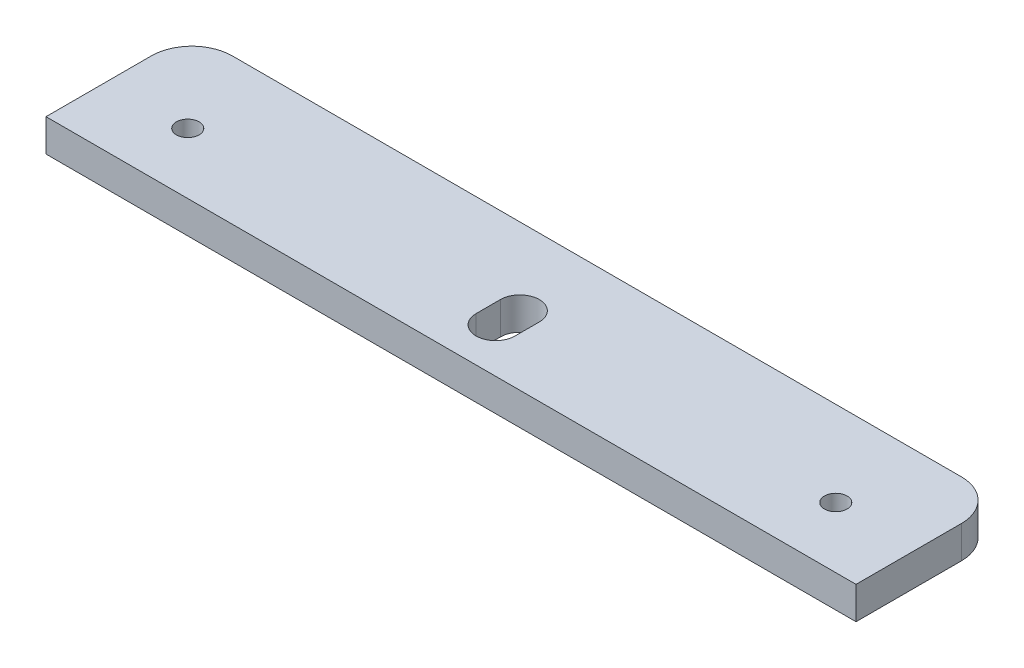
ISO-10303-21;
HEADER;
FILE_DESCRIPTION(('STEP AP214'),'2;1');
FILE_NAME('part.step','',(''),(''),'','','');
FILE_SCHEMA(('AUTOMOTIVE_DESIGN { 1 0 10303 214 1 1 1 1 }'));
ENDSEC;
DATA;
#1=APPLICATION_CONTEXT('core data for automotive mechanical design processes');
#2=APPLICATION_PROTOCOL_DEFINITION('international standard','automotive_design',2000,#1);
#3=PRODUCT_CONTEXT('',#1,'mechanical');
#4=PRODUCT('Part','Part','',(#3));
#5=PRODUCT_RELATED_PRODUCT_CATEGORY('part','',(#4));
#6=PRODUCT_DEFINITION_FORMATION('','',#4);
#7=PRODUCT_DEFINITION_CONTEXT('part definition',#1,'design');
#8=PRODUCT_DEFINITION('design','',#6,#7);
#9=PRODUCT_DEFINITION_SHAPE('','',#8);
#10=(LENGTH_UNIT() NAMED_UNIT(*) SI_UNIT(.MILLI.,.METRE.));
#11=(NAMED_UNIT(*) PLANE_ANGLE_UNIT() SI_UNIT($,.RADIAN.));
#12=(NAMED_UNIT(*) SI_UNIT($,.STERADIAN.) SOLID_ANGLE_UNIT());
#13=UNCERTAINTY_MEASURE_WITH_UNIT(LENGTH_MEASURE(1.E-05),#10,'distance_accuracy_value','');
#14=(GEOMETRIC_REPRESENTATION_CONTEXT(3) GLOBAL_UNCERTAINTY_ASSIGNED_CONTEXT((#13)) GLOBAL_UNIT_ASSIGNED_CONTEXT((#10,
#11,#12)) REPRESENTATION_CONTEXT('',''));
#15=CARTESIAN_POINT('',(0.,0.,0.));
#16=DIRECTION('',(0.,0.,1.));
#17=DIRECTION('',(1.,0.,0.));
#18=AXIS2_PLACEMENT_3D('',#15,#16,#17);
#19=CARTESIAN_POINT('',(0.,5.08,0.));
#20=DIRECTION('',(0.,1.,0.));
#21=DIRECTION('',(0.,0.,1.));
#22=AXIS2_PLACEMENT_3D('',#19,#20,#21);
#23=PLANE('',#22);
#24=CARTESIAN_POINT('',(50.8,5.08,-9.525));
#25=DIRECTION('',(0.,-1.,0.));
#26=DIRECTION('',(0.,0.,1.));
#27=AXIS2_PLACEMENT_3D('',#24,#25,#26);
#28=CIRCLE('',#27,1.778);
#29=CARTESIAN_POINT('',(50.8,5.08,-7.747));
#30=VERTEX_POINT('',#29);
#31=EDGE_CURVE('E263',#30,#30,#28,.T.);
#32=ORIENTED_EDGE('',*,*,#31,.T.);
#33=EDGE_LOOP('',(#32));
#34=FACE_BOUND('',#33,.T.);
#35=DIRECTION('',(0.,0.,1.));
#36=VECTOR('',#35,1.);
#37=CARTESIAN_POINT('',(63.5,5.08,0.));
#38=LINE('',#37,#36);
#39=CARTESIAN_POINT('',(63.5,5.08,-16.51));
#40=VERTEX_POINT('',#39);
#41=CARTESIAN_POINT('',(63.5,5.08,0.));
#42=VERTEX_POINT('',#41);
#43=EDGE_CURVE('E141',#40,#42,#38,.T.);
#44=ORIENTED_EDGE('',*,*,#43,.F.);
#45=CARTESIAN_POINT('',(57.15,5.08,-16.51));
#46=DIRECTION('',(0.,1.,0.));
#47=DIRECTION('',(0.,0.,1.));
#48=AXIS2_PLACEMENT_3D('',#45,#46,#47);
#49=CIRCLE('',#48,6.35);
#50=CARTESIAN_POINT('',(57.15,5.08,-22.86));
#51=VERTEX_POINT('',#50);
#52=EDGE_CURVE('E11',#40,#51,#49,.T.);
#53=ORIENTED_EDGE('',*,*,#52,.T.);
#54=DIRECTION('',(-1.,0.,0.));
#55=VECTOR('',#54,1.);
#56=CARTESIAN_POINT('',(0.,5.08,-22.86));
#57=LINE('',#56,#55);
#58=CARTESIAN_POINT('',(-57.15,5.08,-22.86));
#59=VERTEX_POINT('',#58);
#60=EDGE_CURVE('E165',#51,#59,#57,.T.);
#61=ORIENTED_EDGE('',*,*,#60,.T.);
#62=CARTESIAN_POINT('',(-57.15,5.08,-16.51));
#63=DIRECTION('',(0.,1.,0.));
#64=DIRECTION('',(0.,0.,1.));
#65=AXIS2_PLACEMENT_3D('',#62,#63,#64);
#66=CIRCLE('',#65,6.35);
#67=CARTESIAN_POINT('',(-63.5,5.08,-16.51));
#68=VERTEX_POINT('',#67);
#69=EDGE_CURVE('E190',#59,#68,#66,.T.);
#70=ORIENTED_EDGE('',*,*,#69,.T.);
#71=DIRECTION('',(0.,0.,1.));
#72=VECTOR('',#71,1.);
#73=CARTESIAN_POINT('',(-63.5,5.08,0.));
#74=LINE('',#73,#72);
#75=CARTESIAN_POINT('',(-63.5,5.08,0.));
#76=VERTEX_POINT('',#75);
#77=EDGE_CURVE('E167',#68,#76,#74,.T.);
#78=ORIENTED_EDGE('',*,*,#77,.T.);
#79=DIRECTION('',(1.,0.,0.));
#80=VECTOR('',#79,1.);
#81=CARTESIAN_POINT('',(0.,5.08,0.));
#82=LINE('',#81,#80);
#83=EDGE_CURVE('E170',#76,#42,#82,.T.);
#84=ORIENTED_EDGE('',*,*,#83,.T.);
#85=EDGE_LOOP('',(#44,#53,#61,#70,#78,#84));
#86=FACE_BOUND('',#85,.T.);
#87=CARTESIAN_POINT('',(-50.8,5.08,-9.525));
#88=DIRECTION('',(0.,1.,0.));
#89=DIRECTION('',(0.,0.,1.));
#90=AXIS2_PLACEMENT_3D('',#87,#88,#89);
#91=CIRCLE('',#90,1.778);
#92=CARTESIAN_POINT('',(-50.8,5.08,-7.747));
#93=VERTEX_POINT('',#92);
#94=EDGE_CURVE('E147',#93,#93,#91,.T.);
#95=ORIENTED_EDGE('',*,*,#94,.F.);
#96=EDGE_LOOP('',(#95));
#97=FACE_BOUND('',#96,.T.);
#98=CARTESIAN_POINT('',(0.,5.08,-10.795));
#99=DIRECTION('',(0.,1.,0.));
#100=DIRECTION('',(0.,0.,1.));
#101=AXIS2_PLACEMENT_3D('',#98,#99,#100);
#102=CIRCLE('',#101,3.048);
#103=CARTESIAN_POINT('',(3.048,5.08,-10.795));
#104=VERTEX_POINT('',#103);
#105=CARTESIAN_POINT('',(-3.048,5.08,-10.795));
#106=VERTEX_POINT('',#105);
#107=EDGE_CURVE('E151',#104,#106,#102,.T.);
#108=ORIENTED_EDGE('',*,*,#107,.F.);
#109=DIRECTION('',(0.,0.,1.));
#110=VECTOR('',#109,1.);
#111=CARTESIAN_POINT('',(3.048,5.08,-10.795));
#112=LINE('',#111,#110);
#113=CARTESIAN_POINT('',(3.048,5.08,-6.98499999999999));
#114=VERTEX_POINT('',#113);
#115=EDGE_CURVE('E131',#104,#114,#112,.T.);
#116=ORIENTED_EDGE('',*,*,#115,.T.);
#117=CARTESIAN_POINT('',(0.,5.08,-6.985));
#118=DIRECTION('',(0.,1.,0.));
#119=DIRECTION('',(0.,0.,1.));
#120=AXIS2_PLACEMENT_3D('',#117,#118,#119);
#121=CIRCLE('',#120,3.048);
#122=CARTESIAN_POINT('',(-3.048,5.08,-6.98499999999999));
#123=VERTEX_POINT('',#122);
#124=EDGE_CURVE('E135',#123,#114,#121,.T.);
#125=ORIENTED_EDGE('',*,*,#124,.F.);
#126=DIRECTION('',(0.,0.,1.));
#127=VECTOR('',#126,1.);
#128=CARTESIAN_POINT('',(-3.048,5.08,-10.795));
#129=LINE('',#128,#127);
#130=EDGE_CURVE('E156',#106,#123,#129,.T.);
#131=ORIENTED_EDGE('',*,*,#130,.F.);
#132=EDGE_LOOP('',(#108,#116,#125,#131));
#133=FACE_BOUND('',#132,.T.);
#134=ADVANCED_FACE('F35',(#34,#86,#97,#133),#23,.T.);
#135=CARTESIAN_POINT('',(0.,0.,0.));
#136=DIRECTION('',(0.,1.,0.));
#137=DIRECTION('',(0.,0.,1.));
#138=AXIS2_PLACEMENT_3D('',#135,#136,#137);
#139=PLANE('',#138);
#140=CARTESIAN_POINT('',(50.8,0.,-9.525));
#141=DIRECTION('',(0.,-1.,0.));
#142=DIRECTION('',(0.,0.,1.));
#143=AXIS2_PLACEMENT_3D('',#140,#141,#142);
#144=CIRCLE('',#143,1.778);
#145=CARTESIAN_POINT('',(50.8,0.,-7.747));
#146=VERTEX_POINT('',#145);
#147=EDGE_CURVE('E261',#146,#146,#144,.T.);
#148=ORIENTED_EDGE('',*,*,#147,.F.);
#149=EDGE_LOOP('',(#148));
#150=FACE_BOUND('',#149,.T.);
#151=CARTESIAN_POINT('',(-50.8,0.,-9.525));
#152=DIRECTION('',(0.,1.,0.));
#153=DIRECTION('',(0.,0.,1.));
#154=AXIS2_PLACEMENT_3D('',#151,#152,#153);
#155=CIRCLE('',#154,1.778);
#156=CARTESIAN_POINT('',(-50.8,0.,-7.747));
#157=VERTEX_POINT('',#156);
#158=EDGE_CURVE('E148',#157,#157,#155,.T.);
#159=ORIENTED_EDGE('',*,*,#158,.T.);
#160=EDGE_LOOP('',(#159));
#161=FACE_BOUND('',#160,.T.);
#162=DIRECTION('',(-1.,0.,0.));
#163=VECTOR('',#162,1.);
#164=CARTESIAN_POINT('',(0.,0.,-22.86));
#165=LINE('',#164,#163);
#166=CARTESIAN_POINT('',(57.15,0.,-22.86));
#167=VERTEX_POINT('',#166);
#168=CARTESIAN_POINT('',(-57.15,0.,-22.86));
#169=VERTEX_POINT('',#168);
#170=EDGE_CURVE('E162',#167,#169,#165,.T.);
#171=ORIENTED_EDGE('',*,*,#170,.F.);
#172=CARTESIAN_POINT('',(57.15,0.,-16.51));
#173=DIRECTION('',(0.,1.,0.));
#174=DIRECTION('',(0.,0.,1.));
#175=AXIS2_PLACEMENT_3D('',#172,#173,#174);
#176=CIRCLE('',#175,6.35);
#177=CARTESIAN_POINT('',(63.5,0.,-16.51));
#178=VERTEX_POINT('',#177);
#179=EDGE_CURVE('E57',#167,#178,#176,.F.);
#180=ORIENTED_EDGE('',*,*,#179,.T.);
#181=DIRECTION('',(0.,0.,1.));
#182=VECTOR('',#181,1.);
#183=CARTESIAN_POINT('',(63.5,0.,0.));
#184=LINE('',#183,#182);
#185=CARTESIAN_POINT('',(63.5,0.,0.));
#186=VERTEX_POINT('',#185);
#187=EDGE_CURVE('E137',#178,#186,#184,.T.);
#188=ORIENTED_EDGE('',*,*,#187,.T.);
#189=DIRECTION('',(1.,0.,0.));
#190=VECTOR('',#189,1.);
#191=CARTESIAN_POINT('',(0.,0.,0.));
#192=LINE('',#191,#190);
#193=CARTESIAN_POINT('',(-63.5,0.,0.));
#194=VERTEX_POINT('',#193);
#195=EDGE_CURVE('E168',#194,#186,#192,.T.);
#196=ORIENTED_EDGE('',*,*,#195,.F.);
#197=DIRECTION('',(0.,0.,1.));
#198=VECTOR('',#197,1.);
#199=CARTESIAN_POINT('',(-63.5,0.,0.));
#200=LINE('',#199,#198);
#201=CARTESIAN_POINT('',(-63.5,0.,-16.51));
#202=VERTEX_POINT('',#201);
#203=EDGE_CURVE('E175',#202,#194,#200,.T.);
#204=ORIENTED_EDGE('',*,*,#203,.F.);
#205=CARTESIAN_POINT('',(-57.15,0.,-16.51));
#206=DIRECTION('',(0.,1.,0.));
#207=DIRECTION('',(0.,0.,1.));
#208=AXIS2_PLACEMENT_3D('',#205,#206,#207);
#209=CIRCLE('',#208,6.35);
#210=EDGE_CURVE('E184',#202,#169,#209,.F.);
#211=ORIENTED_EDGE('',*,*,#210,.T.);
#212=EDGE_LOOP('',(#171,#180,#188,#196,#204,#211));
#213=FACE_BOUND('',#212,.T.);
#214=DIRECTION('',(0.,0.,1.));
#215=VECTOR('',#214,1.);
#216=CARTESIAN_POINT('',(3.048,0.,-10.795));
#217=LINE('',#216,#215);
#218=CARTESIAN_POINT('',(3.048,0.,-10.795));
#219=VERTEX_POINT('',#218);
#220=CARTESIAN_POINT('',(3.048,0.,-6.98499999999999));
#221=VERTEX_POINT('',#220);
#222=EDGE_CURVE('E114',#219,#221,#217,.T.);
#223=ORIENTED_EDGE('',*,*,#222,.F.);
#224=CARTESIAN_POINT('',(0.,0.,-10.795));
#225=DIRECTION('',(0.,1.,0.));
#226=DIRECTION('',(0.,0.,1.));
#227=AXIS2_PLACEMENT_3D('',#224,#225,#226);
#228=CIRCLE('',#227,3.048);
#229=CARTESIAN_POINT('',(-3.048,0.,-10.795));
#230=VERTEX_POINT('',#229);
#231=EDGE_CURVE('E192',#219,#230,#228,.T.);
#232=ORIENTED_EDGE('',*,*,#231,.T.);
#233=DIRECTION('',(0.,0.,1.));
#234=VECTOR('',#233,1.);
#235=CARTESIAN_POINT('',(-3.048,0.,-10.795));
#236=LINE('',#235,#234);
#237=CARTESIAN_POINT('',(-3.048,0.,-6.98499999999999));
#238=VERTEX_POINT('',#237);
#239=EDGE_CURVE('E116',#230,#238,#236,.T.);
#240=ORIENTED_EDGE('',*,*,#239,.T.);
#241=CARTESIAN_POINT('',(0.,0.,-6.985));
#242=DIRECTION('',(0.,1.,0.));
#243=DIRECTION('',(0.,0.,1.));
#244=AXIS2_PLACEMENT_3D('',#241,#242,#243);
#245=CIRCLE('',#244,3.048);
#246=EDGE_CURVE('E110',#238,#221,#245,.T.);
#247=ORIENTED_EDGE('',*,*,#246,.T.);
#248=EDGE_LOOP('',(#223,#232,#240,#247));
#249=FACE_BOUND('',#248,.T.);
#250=ADVANCED_FACE('F112',(#150,#161,#213,#249),#139,.F.);
#251=CARTESIAN_POINT('',(0.,5.08,-22.86));
#252=DIRECTION('',(0.,0.,1.));
#253=DIRECTION('',(1.,0.,0.));
#254=AXIS2_PLACEMENT_3D('',#251,#252,#253);
#255=PLANE('',#254);
#256=ORIENTED_EDGE('',*,*,#60,.F.);
#257=DIRECTION('',(0.,-1.,0.));
#258=VECTOR('',#257,1.);
#259=CARTESIAN_POINT('',(57.15,0.,-22.86));
#260=LINE('',#259,#258);
#261=EDGE_CURVE('E194',#51,#167,#260,.T.);
#262=ORIENTED_EDGE('',*,*,#261,.T.);
#263=ORIENTED_EDGE('',*,*,#170,.T.);
#264=DIRECTION('',(0.,-1.,0.));
#265=VECTOR('',#264,1.);
#266=CARTESIAN_POINT('',(-57.15,5.08,-22.86));
#267=LINE('',#266,#265);
#268=EDGE_CURVE('E187',#169,#59,#267,.F.);
#269=ORIENTED_EDGE('',*,*,#268,.T.);
#270=EDGE_LOOP('',(#256,#262,#263,#269));
#271=FACE_BOUND('',#270,.T.);
#272=ADVANCED_FACE('F200',(#271),#255,.F.);
#273=CARTESIAN_POINT('',(-63.5,5.08,0.));
#274=DIRECTION('',(1.,0.,0.));
#275=DIRECTION('',(0.,0.,-1.));
#276=AXIS2_PLACEMENT_3D('',#273,#274,#275);
#277=PLANE('',#276);
#278=ORIENTED_EDGE('',*,*,#77,.F.);
#279=DIRECTION('',(0.,-1.,0.));
#280=VECTOR('',#279,1.);
#281=CARTESIAN_POINT('',(-63.5,5.08,-16.51));
#282=LINE('',#281,#280);
#283=EDGE_CURVE('E181',#68,#202,#282,.T.);
#284=ORIENTED_EDGE('',*,*,#283,.T.);
#285=ORIENTED_EDGE('',*,*,#203,.T.);
#286=DIRECTION('',(0.,-1.,0.));
#287=VECTOR('',#286,1.);
#288=CARTESIAN_POINT('',(-63.5,5.08,0.));
#289=LINE('',#288,#287);
#290=EDGE_CURVE('E173',#76,#194,#289,.T.);
#291=ORIENTED_EDGE('',*,*,#290,.F.);
#292=EDGE_LOOP('',(#278,#284,#285,#291));
#293=FACE_BOUND('',#292,.T.);
#294=ADVANCED_FACE('F215',(#293),#277,.F.);
#295=CARTESIAN_POINT('',(0.,5.08,0.));
#296=DIRECTION('',(0.,0.,-1.));
#297=DIRECTION('',(-1.,0.,0.));
#298=AXIS2_PLACEMENT_3D('',#295,#296,#297);
#299=PLANE('',#298);
#300=ORIENTED_EDGE('',*,*,#195,.T.);
#301=DIRECTION('',(0.,-1.,0.));
#302=VECTOR('',#301,1.);
#303=CARTESIAN_POINT('',(63.5,5.08,0.));
#304=LINE('',#303,#302);
#305=EDGE_CURVE('E143',#42,#186,#304,.T.);
#306=ORIENTED_EDGE('',*,*,#305,.F.);
#307=ORIENTED_EDGE('',*,*,#83,.F.);
#308=ORIENTED_EDGE('',*,*,#290,.T.);
#309=EDGE_LOOP('',(#300,#306,#307,#308));
#310=FACE_BOUND('',#309,.T.);
#311=ADVANCED_FACE('F219',(#310),#299,.F.);
#312=CARTESIAN_POINT('',(-57.15,5.08,-16.51));
#313=DIRECTION('',(0.,-1.,0.));
#314=DIRECTION('',(0.,0.,-1.));
#315=AXIS2_PLACEMENT_3D('',#312,#313,#314);
#316=CYLINDRICAL_SURFACE('',#315,6.35);
#317=ORIENTED_EDGE('',*,*,#69,.F.);
#318=ORIENTED_EDGE('',*,*,#268,.F.);
#319=ORIENTED_EDGE('',*,*,#210,.F.);
#320=ORIENTED_EDGE('',*,*,#283,.F.);
#321=EDGE_LOOP('',(#317,#318,#319,#320));
#322=FACE_BOUND('',#321,.T.);
#323=ADVANCED_FACE('F209',(#322),#316,.T.);
#324=CARTESIAN_POINT('',(0.,0.,-10.795));
#325=DIRECTION('',(0.,1.,0.));
#326=DIRECTION('',(0.,0.,1.));
#327=AXIS2_PLACEMENT_3D('',#324,#325,#326);
#328=CYLINDRICAL_SURFACE('',#327,3.048);
#329=ORIENTED_EDGE('',*,*,#107,.T.);
#330=DIRECTION('',(0.,1.,0.));
#331=VECTOR('',#330,1.);
#332=CARTESIAN_POINT('',(-3.048,0.,-10.795));
#333=LINE('',#332,#331);
#334=EDGE_CURVE('E120',#230,#106,#333,.T.);
#335=ORIENTED_EDGE('',*,*,#334,.F.);
#336=ORIENTED_EDGE('',*,*,#231,.F.);
#337=DIRECTION('',(0.,1.,0.));
#338=VECTOR('',#337,1.);
#339=CARTESIAN_POINT('',(3.048,0.,-10.795));
#340=LINE('',#339,#338);
#341=EDGE_CURVE('E130',#219,#104,#340,.T.);
#342=ORIENTED_EDGE('',*,*,#341,.T.);
#343=EDGE_LOOP('',(#329,#335,#336,#342));
#344=FACE_BOUND('',#343,.T.);
#345=ADVANCED_FACE('F240',(#344),#328,.F.);
#346=CARTESIAN_POINT('',(0.,0.,-6.985));
#347=DIRECTION('',(0.,1.,0.));
#348=DIRECTION('',(0.,0.,1.));
#349=AXIS2_PLACEMENT_3D('',#346,#347,#348);
#350=CYLINDRICAL_SURFACE('',#349,3.048);
#351=ORIENTED_EDGE('',*,*,#246,.F.);
#352=DIRECTION('',(0.,1.,0.));
#353=VECTOR('',#352,1.);
#354=CARTESIAN_POINT('',(-3.048,0.,-6.98499999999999));
#355=LINE('',#354,#353);
#356=EDGE_CURVE('E160',#238,#123,#355,.T.);
#357=ORIENTED_EDGE('',*,*,#356,.T.);
#358=ORIENTED_EDGE('',*,*,#124,.T.);
#359=DIRECTION('',(0.,1.,0.));
#360=VECTOR('',#359,1.);
#361=CARTESIAN_POINT('',(3.048,0.,-6.98499999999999));
#362=LINE('',#361,#360);
#363=EDGE_CURVE('E127',#221,#114,#362,.T.);
#364=ORIENTED_EDGE('',*,*,#363,.F.);
#365=EDGE_LOOP('',(#351,#357,#358,#364));
#366=FACE_BOUND('',#365,.T.);
#367=ADVANCED_FACE('F133',(#366),#350,.F.);
#368=CARTESIAN_POINT('',(-3.048,0.,-10.795));
#369=DIRECTION('',(-1.,0.,0.));
#370=DIRECTION('',(0.,0.,1.));
#371=AXIS2_PLACEMENT_3D('',#368,#369,#370);
#372=PLANE('',#371);
#373=ORIENTED_EDGE('',*,*,#130,.T.);
#374=ORIENTED_EDGE('',*,*,#356,.F.);
#375=ORIENTED_EDGE('',*,*,#239,.F.);
#376=ORIENTED_EDGE('',*,*,#334,.T.);
#377=EDGE_LOOP('',(#373,#374,#375,#376));
#378=FACE_BOUND('',#377,.T.);
#379=ADVANCED_FACE('F256',(#378),#372,.F.);
#380=CARTESIAN_POINT('',(-50.8,0.,-9.525));
#381=DIRECTION('',(0.,1.,0.));
#382=DIRECTION('',(0.,0.,1.));
#383=AXIS2_PLACEMENT_3D('',#380,#381,#382);
#384=CYLINDRICAL_SURFACE('',#383,1.778);
#385=ORIENTED_EDGE('',*,*,#158,.F.);
#386=EDGE_LOOP('',(#385));
#387=FACE_BOUND('',#386,.T.);
#388=ORIENTED_EDGE('',*,*,#94,.T.);
#389=EDGE_LOOP('',(#388));
#390=FACE_BOUND('',#389,.T.);
#391=ADVANCED_FACE('F228',(#387,#390),#384,.F.);
#392=CARTESIAN_POINT('',(63.5,5.08,0.));
#393=DIRECTION('',(1.,0.,0.));
#394=DIRECTION('',(0.,0.,-1.));
#395=AXIS2_PLACEMENT_3D('',#392,#393,#394);
#396=PLANE('',#395);
#397=ORIENTED_EDGE('',*,*,#187,.F.);
#398=DIRECTION('',(0.,-1.,0.));
#399=VECTOR('',#398,1.);
#400=CARTESIAN_POINT('',(63.5,5.08,-16.51));
#401=LINE('',#400,#399);
#402=EDGE_CURVE('E43',#178,#40,#401,.F.);
#403=ORIENTED_EDGE('',*,*,#402,.T.);
#404=ORIENTED_EDGE('',*,*,#43,.T.);
#405=ORIENTED_EDGE('',*,*,#305,.T.);
#406=EDGE_LOOP('',(#397,#403,#404,#405));
#407=FACE_BOUND('',#406,.T.);
#408=ADVANCED_FACE('F221',(#407),#396,.T.);
#409=CARTESIAN_POINT('',(57.15,5.08,-16.51));
#410=DIRECTION('',(0.,1.,0.));
#411=DIRECTION('',(0.,0.,1.));
#412=AXIS2_PLACEMENT_3D('',#409,#410,#411);
#413=CYLINDRICAL_SURFACE('',#412,6.35);
#414=ORIENTED_EDGE('',*,*,#52,.F.);
#415=ORIENTED_EDGE('',*,*,#402,.F.);
#416=ORIENTED_EDGE('',*,*,#179,.F.);
#417=ORIENTED_EDGE('',*,*,#261,.F.);
#418=EDGE_LOOP('',(#414,#415,#416,#417));
#419=FACE_BOUND('',#418,.T.);
#420=ADVANCED_FACE('F37',(#419),#413,.T.);
#421=CARTESIAN_POINT('',(3.048,0.,-10.795));
#422=DIRECTION('',(-1.,0.,0.));
#423=DIRECTION('',(0.,0.,1.));
#424=AXIS2_PLACEMENT_3D('',#421,#422,#423);
#425=PLANE('',#424);
#426=ORIENTED_EDGE('',*,*,#115,.F.);
#427=ORIENTED_EDGE('',*,*,#341,.F.);
#428=ORIENTED_EDGE('',*,*,#222,.T.);
#429=ORIENTED_EDGE('',*,*,#363,.T.);
#430=EDGE_LOOP('',(#426,#427,#428,#429));
#431=FACE_BOUND('',#430,.T.);
#432=ADVANCED_FACE('F126',(#431),#425,.T.);
#433=CARTESIAN_POINT('',(50.8,0.,-9.525));
#434=DIRECTION('',(0.,1.,0.));
#435=DIRECTION('',(0.,0.,1.));
#436=AXIS2_PLACEMENT_3D('',#433,#434,#435);
#437=CYLINDRICAL_SURFACE('',#436,1.778);
#438=ORIENTED_EDGE('',*,*,#147,.T.);
#439=EDGE_LOOP('',(#438));
#440=FACE_BOUND('',#439,.T.);
#441=ORIENTED_EDGE('',*,*,#31,.F.);
#442=EDGE_LOOP('',(#441));
#443=FACE_BOUND('',#442,.T.);
#444=ADVANCED_FACE('F226',(#440,#443),#437,.F.);
#445=CLOSED_SHELL('',(#134,#250,#272,#294,#311,#323,#345,#367,#379,#391,#408,#420,#432,#444));
#446=MANIFOLD_SOLID_BREP('B2',#445);
#447=ADVANCED_BREP_SHAPE_REPRESENTATION('',(#18,#446),#14);
#448=SHAPE_DEFINITION_REPRESENTATION(#9,#447);
ENDSEC;
END-ISO-10303-21;
